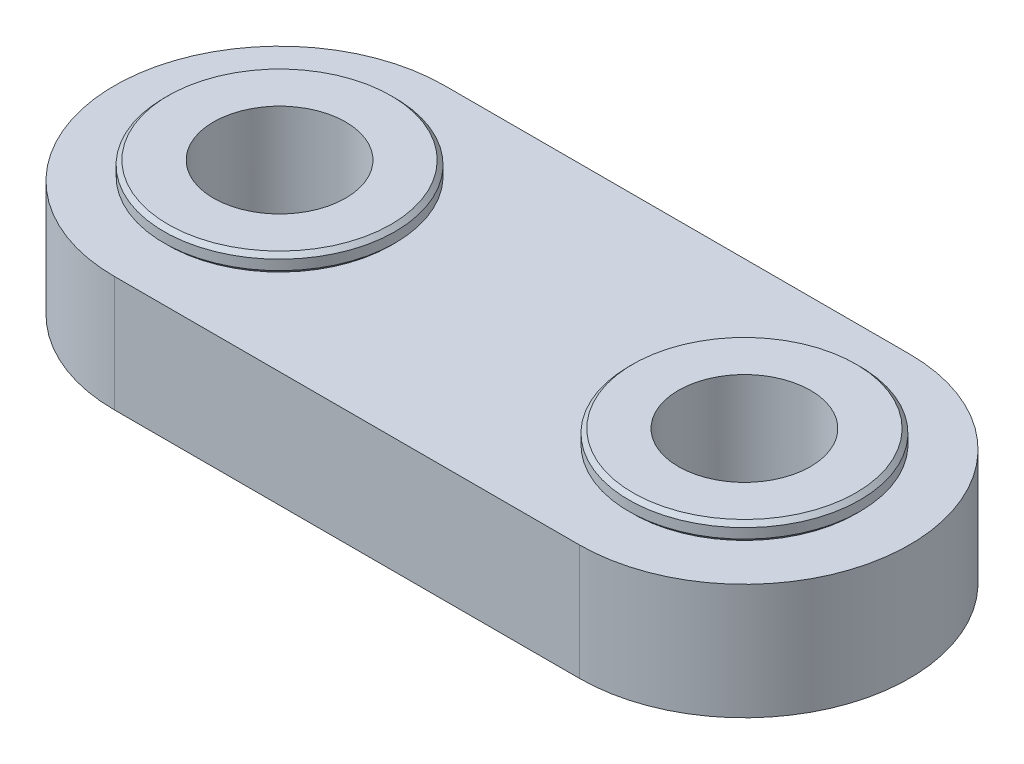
ISO-10303-21;
HEADER;
FILE_DESCRIPTION(('STEP AP214'),'2;1');
FILE_NAME('part.step','',(''),(''),'','','');
FILE_SCHEMA(('AUTOMOTIVE_DESIGN { 1 0 10303 214 1 1 1 1 }'));
ENDSEC;
DATA;
#1=APPLICATION_CONTEXT('core data for automotive mechanical design processes');
#2=APPLICATION_PROTOCOL_DEFINITION('international standard','automotive_design',2000,#1);
#3=PRODUCT_CONTEXT('',#1,'mechanical');
#4=PRODUCT('Part','Part','',(#3));
#5=PRODUCT_RELATED_PRODUCT_CATEGORY('part','',(#4));
#6=PRODUCT_DEFINITION_FORMATION('','',#4);
#7=PRODUCT_DEFINITION_CONTEXT('part definition',#1,'design');
#8=PRODUCT_DEFINITION('design','',#6,#7);
#9=PRODUCT_DEFINITION_SHAPE('','',#8);
#10=(LENGTH_UNIT() NAMED_UNIT(*) SI_UNIT(.MILLI.,.METRE.));
#11=(NAMED_UNIT(*) PLANE_ANGLE_UNIT() SI_UNIT($,.RADIAN.));
#12=(NAMED_UNIT(*) SI_UNIT($,.STERADIAN.) SOLID_ANGLE_UNIT());
#13=UNCERTAINTY_MEASURE_WITH_UNIT(LENGTH_MEASURE(1.E-05),#10,'distance_accuracy_value','');
#14=(GEOMETRIC_REPRESENTATION_CONTEXT(3) GLOBAL_UNCERTAINTY_ASSIGNED_CONTEXT((#13)) GLOBAL_UNIT_ASSIGNED_CONTEXT((#10,
#11,#12)) REPRESENTATION_CONTEXT('',''));
#15=CARTESIAN_POINT('',(0.,0.,0.));
#16=DIRECTION('',(0.,0.,1.));
#17=DIRECTION('',(1.,0.,0.));
#18=AXIS2_PLACEMENT_3D('',#15,#16,#17);
#19=CARTESIAN_POINT('',(28.1439999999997,-4.6,-2.77555756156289E-13));
#20=DIRECTION('',(0.,1.,0.));
#21=DIRECTION('',(-1.,0.,0.));
#22=AXIS2_PLACEMENT_3D('',#19,#20,#21);
#23=CYLINDRICAL_SURFACE('',#22,7.);
#24=CARTESIAN_POINT('',(28.1439999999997,4.35,-2.77555756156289E-13));
#25=DIRECTION('',(0.,1.,0.));
#26=DIRECTION('',(1.,0.,0.));
#27=AXIS2_PLACEMENT_3D('',#24,#25,#26);
#28=CIRCLE('',#27,7.);
#29=CARTESIAN_POINT('',(35.1439999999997,4.35,-2.77555756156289E-13));
#30=VERTEX_POINT('',#29);
#31=EDGE_CURVE('E145',#30,#30,#28,.F.);
#32=ORIENTED_EDGE('',*,*,#31,.T.);
#33=EDGE_LOOP('',(#32));
#34=FACE_BOUND('',#33,.T.);
#35=CARTESIAN_POINT('',(28.1439999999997,3.75,-2.77555756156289E-13));
#36=DIRECTION('',(0.,1.,0.));
#37=DIRECTION('',(-1.,0.,0.));
#38=AXIS2_PLACEMENT_3D('',#35,#36,#37);
#39=CIRCLE('',#38,7.);
#40=CARTESIAN_POINT('',(21.1439999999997,3.75,-2.77555756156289E-13));
#41=VERTEX_POINT('',#40);
#42=EDGE_CURVE('E119',#41,#41,#39,.T.);
#43=ORIENTED_EDGE('',*,*,#42,.T.);
#44=EDGE_LOOP('',(#43));
#45=FACE_BOUND('',#44,.T.);
#46=ADVANCED_FACE('F14',(#34,#45),#23,.T.);
#47=CARTESIAN_POINT('',(28.1439999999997,-4.6,-2.77555756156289E-13));
#48=DIRECTION('',(0.,1.,0.));
#49=DIRECTION('',(-1.,0.,0.));
#50=AXIS2_PLACEMENT_3D('',#47,#48,#49);
#51=CYLINDRICAL_SURFACE('',#50,4.);
#52=CARTESIAN_POINT('',(28.1439999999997,-4.6,-2.77555756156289E-13));
#53=DIRECTION('',(0.,1.,0.));
#54=DIRECTION('',(-1.,0.,0.));
#55=AXIS2_PLACEMENT_3D('',#52,#53,#54);
#56=CIRCLE('',#55,4.);
#57=CARTESIAN_POINT('',(24.1439999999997,-4.6,-2.77555756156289E-13));
#58=VERTEX_POINT('',#57);
#59=EDGE_CURVE('E116',#58,#58,#56,.T.);
#60=ORIENTED_EDGE('',*,*,#59,.F.);
#61=EDGE_LOOP('',(#60));
#62=FACE_BOUND('',#61,.T.);
#63=CARTESIAN_POINT('',(28.1439999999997,4.6,-2.77555756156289E-13));
#64=DIRECTION('',(0.,1.,0.));
#65=DIRECTION('',(1.,0.,0.));
#66=AXIS2_PLACEMENT_3D('',#63,#64,#65);
#67=CIRCLE('',#66,4.);
#68=CARTESIAN_POINT('',(32.1439999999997,4.6,-2.77555756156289E-13));
#69=VERTEX_POINT('',#68);
#70=EDGE_CURVE('E227',#69,#69,#67,.T.);
#71=ORIENTED_EDGE('',*,*,#70,.T.);
#72=EDGE_LOOP('',(#71));
#73=FACE_BOUND('',#72,.T.);
#74=ADVANCED_FACE('F165',(#62,#73),#51,.F.);
#75=CARTESIAN_POINT('',(0.,-4.6,0.));
#76=DIRECTION('',(0.,1.,0.));
#77=DIRECTION('',(-1.,0.,0.));
#78=AXIS2_PLACEMENT_3D('',#75,#76,#77);
#79=CYLINDRICAL_SURFACE('',#78,7.);
#80=CARTESIAN_POINT('',(0.,4.35,0.));
#81=DIRECTION('',(0.,1.,0.));
#82=DIRECTION('',(1.,0.,0.));
#83=AXIS2_PLACEMENT_3D('',#80,#81,#82);
#84=CIRCLE('',#83,7.);
#85=CARTESIAN_POINT('',(7.,4.35,0.));
#86=VERTEX_POINT('',#85);
#87=EDGE_CURVE('E9',#86,#86,#84,.F.);
#88=ORIENTED_EDGE('',*,*,#87,.T.);
#89=EDGE_LOOP('',(#88));
#90=FACE_BOUND('',#89,.T.);
#91=CARTESIAN_POINT('',(0.,3.75,0.));
#92=DIRECTION('',(0.,1.,0.));
#93=DIRECTION('',(-1.,0.,0.));
#94=AXIS2_PLACEMENT_3D('',#91,#92,#93);
#95=CIRCLE('',#94,7.);
#96=CARTESIAN_POINT('',(-7.,3.75,0.));
#97=VERTEX_POINT('',#96);
#98=EDGE_CURVE('E113',#97,#97,#95,.T.);
#99=ORIENTED_EDGE('',*,*,#98,.T.);
#100=EDGE_LOOP('',(#99));
#101=FACE_BOUND('',#100,.T.);
#102=ADVANCED_FACE('F172',(#90,#101),#79,.T.);
#103=CARTESIAN_POINT('',(0.,-4.6,0.));
#104=DIRECTION('',(0.,1.,0.));
#105=DIRECTION('',(-1.,0.,0.));
#106=AXIS2_PLACEMENT_3D('',#103,#104,#105);
#107=CYLINDRICAL_SURFACE('',#106,4.);
#108=CARTESIAN_POINT('',(0.,-4.6,0.));
#109=DIRECTION('',(0.,1.,0.));
#110=DIRECTION('',(-1.,0.,0.));
#111=AXIS2_PLACEMENT_3D('',#108,#109,#110);
#112=CIRCLE('',#111,4.);
#113=CARTESIAN_POINT('',(-4.,-4.6,0.));
#114=VERTEX_POINT('',#113);
#115=EDGE_CURVE('E108',#114,#114,#112,.T.);
#116=ORIENTED_EDGE('',*,*,#115,.F.);
#117=EDGE_LOOP('',(#116));
#118=FACE_BOUND('',#117,.T.);
#119=CARTESIAN_POINT('',(0.,4.6,0.));
#120=DIRECTION('',(0.,1.,0.));
#121=DIRECTION('',(1.,0.,0.));
#122=AXIS2_PLACEMENT_3D('',#119,#120,#121);
#123=CIRCLE('',#122,4.);
#124=CARTESIAN_POINT('',(4.,4.6,0.));
#125=VERTEX_POINT('',#124);
#126=EDGE_CURVE('E130',#125,#125,#123,.T.);
#127=ORIENTED_EDGE('',*,*,#126,.T.);
#128=EDGE_LOOP('',(#127));
#129=FACE_BOUND('',#128,.T.);
#130=ADVANCED_FACE('F178',(#118,#129),#107,.F.);
#131=CARTESIAN_POINT('',(0.,0.,0.));
#132=DIRECTION('',(0.,-1.,0.));
#133=DIRECTION('',(-1.,0.,0.));
#134=AXIS2_PLACEMENT_3D('',#131,#132,#133);
#135=CYLINDRICAL_SURFACE('',#134,10.);
#136=CARTESIAN_POINT('',(0.,-3.5,0.));
#137=DIRECTION('',(0.,1.,0.));
#138=DIRECTION('',(1.,0.,0.));
#139=AXIS2_PLACEMENT_3D('',#136,#137,#138);
#140=CIRCLE('',#139,10.);
#141=CARTESIAN_POINT('',(0.,-3.5,-10.));
#142=VERTEX_POINT('',#141);
#143=CARTESIAN_POINT('',(0.,-3.5,10.));
#144=VERTEX_POINT('',#143);
#145=EDGE_CURVE('E59',#142,#144,#140,.T.);
#146=ORIENTED_EDGE('',*,*,#145,.T.);
#147=DIRECTION('',(0.,-1.,0.));
#148=VECTOR('',#147,1.);
#149=CARTESIAN_POINT('',(0.,0.,10.));
#150=LINE('',#149,#148);
#151=CARTESIAN_POINT('',(0.,3.5,10.));
#152=VERTEX_POINT('',#151);
#153=EDGE_CURVE('E65',#152,#144,#150,.T.);
#154=ORIENTED_EDGE('',*,*,#153,.F.);
#155=CARTESIAN_POINT('',(0.,3.5,0.));
#156=DIRECTION('',(0.,1.,0.));
#157=DIRECTION('',(1.,0.,0.));
#158=AXIS2_PLACEMENT_3D('',#155,#156,#157);
#159=CIRCLE('',#158,10.);
#160=CARTESIAN_POINT('',(0.,3.5,-10.));
#161=VERTEX_POINT('',#160);
#162=EDGE_CURVE('E99',#161,#152,#159,.T.);
#163=ORIENTED_EDGE('',*,*,#162,.F.);
#164=DIRECTION('',(0.,-1.,0.));
#165=VECTOR('',#164,1.);
#166=CARTESIAN_POINT('',(0.,0.,-10.));
#167=LINE('',#166,#165);
#168=EDGE_CURVE('E67',#161,#142,#167,.T.);
#169=ORIENTED_EDGE('',*,*,#168,.T.);
#170=EDGE_LOOP('',(#146,#154,#163,#169));
#171=FACE_BOUND('',#170,.T.);
#172=ADVANCED_FACE('F63',(#171),#135,.T.);
#173=CARTESIAN_POINT('',(0.,0.,10.));
#174=DIRECTION('',(0.,0.,-1.));
#175=DIRECTION('',(0.,1.,0.));
#176=AXIS2_PLACEMENT_3D('',#173,#174,#175);
#177=PLANE('',#176);
#178=DIRECTION('',(1.,0.,0.));
#179=VECTOR('',#178,1.);
#180=CARTESIAN_POINT('',(0.,-3.5,10.));
#181=LINE('',#180,#179);
#182=CARTESIAN_POINT('',(28.144,-3.5,10.));
#183=VERTEX_POINT('',#182);
#184=EDGE_CURVE('E70',#144,#183,#181,.T.);
#185=ORIENTED_EDGE('',*,*,#184,.T.);
#186=DIRECTION('',(0.,-1.,0.));
#187=VECTOR('',#186,1.);
#188=CARTESIAN_POINT('',(28.144,0.,10.));
#189=LINE('',#188,#187);
#190=CARTESIAN_POINT('',(28.144,3.5,10.));
#191=VERTEX_POINT('',#190);
#192=EDGE_CURVE('E47',#191,#183,#189,.T.);
#193=ORIENTED_EDGE('',*,*,#192,.F.);
#194=DIRECTION('',(1.,0.,0.));
#195=VECTOR('',#194,1.);
#196=CARTESIAN_POINT('',(0.,3.5,10.));
#197=LINE('',#196,#195);
#198=EDGE_CURVE('E74',#152,#191,#197,.T.);
#199=ORIENTED_EDGE('',*,*,#198,.F.);
#200=ORIENTED_EDGE('',*,*,#153,.T.);
#201=EDGE_LOOP('',(#185,#193,#199,#200));
#202=FACE_BOUND('',#201,.T.);
#203=ADVANCED_FACE('F73',(#202),#177,.F.);
#204=CARTESIAN_POINT('',(28.144,0.,0.));
#205=DIRECTION('',(0.,-1.,0.));
#206=DIRECTION('',(-1.,0.,0.));
#207=AXIS2_PLACEMENT_3D('',#204,#205,#206);
#208=CYLINDRICAL_SURFACE('',#207,10.);
#209=CARTESIAN_POINT('',(28.144,-3.5,0.));
#210=DIRECTION('',(0.,1.,0.));
#211=DIRECTION('',(-1.,0.,0.));
#212=AXIS2_PLACEMENT_3D('',#209,#210,#211);
#213=CIRCLE('',#212,10.);
#214=CARTESIAN_POINT('',(28.144,-3.5,-10.));
#215=VERTEX_POINT('',#214);
#216=EDGE_CURVE('E31',#183,#215,#213,.T.);
#217=ORIENTED_EDGE('',*,*,#216,.T.);
#218=DIRECTION('',(0.,-1.,0.));
#219=VECTOR('',#218,1.);
#220=CARTESIAN_POINT('',(28.144,0.,-10.));
#221=LINE('',#220,#219);
#222=CARTESIAN_POINT('',(28.144,3.5,-10.));
#223=VERTEX_POINT('',#222);
#224=EDGE_CURVE('E51',#223,#215,#221,.T.);
#225=ORIENTED_EDGE('',*,*,#224,.F.);
#226=CARTESIAN_POINT('',(28.144,3.5,0.));
#227=DIRECTION('',(0.,1.,0.));
#228=DIRECTION('',(-1.,0.,0.));
#229=AXIS2_PLACEMENT_3D('',#226,#227,#228);
#230=CIRCLE('',#229,10.);
#231=EDGE_CURVE('E103',#191,#223,#230,.T.);
#232=ORIENTED_EDGE('',*,*,#231,.F.);
#233=ORIENTED_EDGE('',*,*,#192,.T.);
#234=EDGE_LOOP('',(#217,#225,#232,#233));
#235=FACE_BOUND('',#234,.T.);
#236=ADVANCED_FACE('F264',(#235),#208,.T.);
#237=CARTESIAN_POINT('',(28.144,0.,-10.));
#238=DIRECTION('',(0.,0.,1.));
#239=DIRECTION('',(0.,-1.,0.));
#240=AXIS2_PLACEMENT_3D('',#237,#238,#239);
#241=PLANE('',#240);
#242=DIRECTION('',(-1.,0.,0.));
#243=VECTOR('',#242,1.);
#244=CARTESIAN_POINT('',(28.144,-3.5,-10.));
#245=LINE('',#244,#243);
#246=EDGE_CURVE('E71',#215,#142,#245,.T.);
#247=ORIENTED_EDGE('',*,*,#246,.T.);
#248=ORIENTED_EDGE('',*,*,#168,.F.);
#249=DIRECTION('',(-1.,0.,0.));
#250=VECTOR('',#249,1.);
#251=CARTESIAN_POINT('',(28.144,3.5,-10.));
#252=LINE('',#251,#250);
#253=EDGE_CURVE('E101',#223,#161,#252,.T.);
#254=ORIENTED_EDGE('',*,*,#253,.F.);
#255=ORIENTED_EDGE('',*,*,#224,.T.);
#256=EDGE_LOOP('',(#247,#248,#254,#255));
#257=FACE_BOUND('',#256,.T.);
#258=ADVANCED_FACE('F262',(#257),#241,.F.);
#259=CARTESIAN_POINT('',(0.,-3.5,0.));
#260=DIRECTION('',(0.,1.,0.));
#261=DIRECTION('',(1.,0.,0.));
#262=AXIS2_PLACEMENT_3D('',#259,#260,#261);
#263=PLANE('',#262);
#264=CARTESIAN_POINT('',(28.1439999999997,-3.5,-2.77555756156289E-13));
#265=DIRECTION('',(0.,1.,0.));
#266=DIRECTION('',(1.,0.,0.));
#267=AXIS2_PLACEMENT_3D('',#264,#265,#266);
#268=CIRCLE('',#267,7.3);
#269=CARTESIAN_POINT('',(35.4439999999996,-3.5,-2.77555756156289E-13));
#270=VERTEX_POINT('',#269);
#271=EDGE_CURVE('E92',#270,#270,#268,.F.);
#272=ORIENTED_EDGE('',*,*,#271,.F.);
#273=EDGE_LOOP('',(#272));
#274=FACE_BOUND('',#273,.T.);
#275=ORIENTED_EDGE('',*,*,#246,.F.);
#276=ORIENTED_EDGE('',*,*,#216,.F.);
#277=ORIENTED_EDGE('',*,*,#184,.F.);
#278=ORIENTED_EDGE('',*,*,#145,.F.);
#279=EDGE_LOOP('',(#275,#276,#277,#278));
#280=FACE_BOUND('',#279,.T.);
#281=CARTESIAN_POINT('',(0.,-3.5,0.));
#282=DIRECTION('',(0.,1.,0.));
#283=DIRECTION('',(1.,0.,0.));
#284=AXIS2_PLACEMENT_3D('',#281,#282,#283);
#285=CIRCLE('',#284,7.3);
#286=CARTESIAN_POINT('',(7.3,-3.5,0.));
#287=VERTEX_POINT('',#286);
#288=EDGE_CURVE('E95',#287,#287,#285,.F.);
#289=ORIENTED_EDGE('',*,*,#288,.F.);
#290=EDGE_LOOP('',(#289));
#291=FACE_BOUND('',#290,.T.);
#292=ADVANCED_FACE('F76',(#274,#280,#291),#263,.F.);
#293=CARTESIAN_POINT('',(28.1439999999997,-3.5,-2.77555756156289E-13));
#294=DIRECTION('',(0.,-1.,0.));
#295=DIRECTION('',(1.,0.,0.));
#296=AXIS2_PLACEMENT_3D('',#293,#294,#295);
#297=CYLINDRICAL_SURFACE('',#296,7.5);
#298=CARTESIAN_POINT('',(28.1439999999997,-4.35,-2.77555756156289E-13));
#299=DIRECTION('',(0.,1.,0.));
#300=DIRECTION('',(1.,0.,0.));
#301=AXIS2_PLACEMENT_3D('',#298,#299,#300);
#302=CIRCLE('',#301,7.5);
#303=CARTESIAN_POINT('',(35.6439999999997,-4.35,-2.77555756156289E-13));
#304=VERTEX_POINT('',#303);
#305=EDGE_CURVE('E139',#304,#304,#302,.T.);
#306=ORIENTED_EDGE('',*,*,#305,.T.);
#307=EDGE_LOOP('',(#306));
#308=FACE_BOUND('',#307,.T.);
#309=CARTESIAN_POINT('',(28.1439999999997,-3.7,-2.77555756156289E-13));
#310=DIRECTION('',(0.,-1.,0.));
#311=DIRECTION('',(1.,0.,0.));
#312=AXIS2_PLACEMENT_3D('',#309,#310,#311);
#313=CIRCLE('',#312,7.5);
#314=CARTESIAN_POINT('',(35.6439999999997,-3.7,-2.77555756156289E-13));
#315=VERTEX_POINT('',#314);
#316=EDGE_CURVE('E127',#315,#315,#313,.T.);
#317=ORIENTED_EDGE('',*,*,#316,.T.);
#318=EDGE_LOOP('',(#317));
#319=FACE_BOUND('',#318,.T.);
#320=ADVANCED_FACE('F201',(#308,#319),#297,.T.);
#321=CARTESIAN_POINT('',(28.1439999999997,-3.5,-2.77555756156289E-13));
#322=DIRECTION('',(0.,-1.,0.));
#323=DIRECTION('',(1.,0.,0.));
#324=AXIS2_PLACEMENT_3D('',#321,#322,#323);
#325=CONICAL_SURFACE('',#324,7.3,0.785398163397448);
#326=ORIENTED_EDGE('',*,*,#316,.F.);
#327=EDGE_LOOP('',(#326));
#328=FACE_BOUND('',#327,.T.);
#329=ORIENTED_EDGE('',*,*,#271,.T.);
#330=EDGE_LOOP('',(#329));
#331=FACE_BOUND('',#330,.T.);
#332=ADVANCED_FACE('F196',(#328,#331),#325,.T.);
#333=CARTESIAN_POINT('',(0.,-3.5,0.));
#334=DIRECTION('',(0.,-1.,0.));
#335=DIRECTION('',(1.,0.,0.));
#336=AXIS2_PLACEMENT_3D('',#333,#334,#335);
#337=CYLINDRICAL_SURFACE('',#336,7.5);
#338=CARTESIAN_POINT('',(0.,-4.35,0.));
#339=DIRECTION('',(0.,1.,0.));
#340=DIRECTION('',(1.,0.,0.));
#341=AXIS2_PLACEMENT_3D('',#338,#339,#340);
#342=CIRCLE('',#341,7.5);
#343=CARTESIAN_POINT('',(7.5,-4.35,0.));
#344=VERTEX_POINT('',#343);
#345=EDGE_CURVE('E133',#344,#344,#342,.T.);
#346=ORIENTED_EDGE('',*,*,#345,.T.);
#347=EDGE_LOOP('',(#346));
#348=FACE_BOUND('',#347,.T.);
#349=CARTESIAN_POINT('',(0.,-3.7,0.));
#350=DIRECTION('',(0.,-1.,0.));
#351=DIRECTION('',(1.,0.,0.));
#352=AXIS2_PLACEMENT_3D('',#349,#350,#351);
#353=CIRCLE('',#352,7.5);
#354=CARTESIAN_POINT('',(7.5,-3.7,0.));
#355=VERTEX_POINT('',#354);
#356=EDGE_CURVE('E122',#355,#355,#353,.T.);
#357=ORIENTED_EDGE('',*,*,#356,.T.);
#358=EDGE_LOOP('',(#357));
#359=FACE_BOUND('',#358,.T.);
#360=ADVANCED_FACE('F192',(#348,#359),#337,.T.);
#361=CARTESIAN_POINT('',(0.,-3.5,0.));
#362=DIRECTION('',(0.,-1.,0.));
#363=DIRECTION('',(1.,0.,0.));
#364=AXIS2_PLACEMENT_3D('',#361,#362,#363);
#365=CONICAL_SURFACE('',#364,7.3,0.785398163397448);
#366=ORIENTED_EDGE('',*,*,#356,.F.);
#367=EDGE_LOOP('',(#366));
#368=FACE_BOUND('',#367,.T.);
#369=ORIENTED_EDGE('',*,*,#288,.T.);
#370=EDGE_LOOP('',(#369));
#371=FACE_BOUND('',#370,.T.);
#372=ADVANCED_FACE('F195',(#368,#371),#365,.T.);
#373=CARTESIAN_POINT('',(0.,3.5,0.));
#374=DIRECTION('',(0.,1.,0.));
#375=DIRECTION('',(-1.,0.,0.));
#376=AXIS2_PLACEMENT_3D('',#373,#374,#375);
#377=CONICAL_SURFACE('',#376,6.75,0.785398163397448);
#378=ORIENTED_EDGE('',*,*,#98,.F.);
#379=EDGE_LOOP('',(#378));
#380=FACE_BOUND('',#379,.T.);
#381=CARTESIAN_POINT('',(0.,3.5,0.));
#382=DIRECTION('',(0.,1.,0.));
#383=DIRECTION('',(1.,0.,0.));
#384=AXIS2_PLACEMENT_3D('',#381,#382,#383);
#385=CIRCLE('',#384,6.75);
#386=CARTESIAN_POINT('',(6.75,3.5,0.));
#387=VERTEX_POINT('',#386);
#388=EDGE_CURVE('E88',#387,#387,#385,.F.);
#389=ORIENTED_EDGE('',*,*,#388,.F.);
#390=EDGE_LOOP('',(#389));
#391=FACE_BOUND('',#390,.T.);
#392=ADVANCED_FACE('F184',(#380,#391),#377,.T.);
#393=CARTESIAN_POINT('',(28.1439999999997,3.5,-2.77555756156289E-13));
#394=DIRECTION('',(0.,1.,0.));
#395=DIRECTION('',(-1.,0.,0.));
#396=AXIS2_PLACEMENT_3D('',#393,#394,#395);
#397=CONICAL_SURFACE('',#396,6.75,0.785398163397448);
#398=ORIENTED_EDGE('',*,*,#42,.F.);
#399=EDGE_LOOP('',(#398));
#400=FACE_BOUND('',#399,.T.);
#401=CARTESIAN_POINT('',(28.1439999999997,3.5,-2.77555756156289E-13));
#402=DIRECTION('',(0.,1.,0.));
#403=DIRECTION('',(1.,0.,0.));
#404=AXIS2_PLACEMENT_3D('',#401,#402,#403);
#405=CIRCLE('',#404,6.75);
#406=CARTESIAN_POINT('',(34.8939999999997,3.5,-2.77555756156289E-13));
#407=VERTEX_POINT('',#406);
#408=EDGE_CURVE('E105',#407,#407,#405,.F.);
#409=ORIENTED_EDGE('',*,*,#408,.F.);
#410=EDGE_LOOP('',(#409));
#411=FACE_BOUND('',#410,.T.);
#412=ADVANCED_FACE('F180',(#400,#411),#397,.T.);
#413=CARTESIAN_POINT('',(0.,3.5,0.));
#414=DIRECTION('',(0.,1.,0.));
#415=DIRECTION('',(1.,0.,0.));
#416=AXIS2_PLACEMENT_3D('',#413,#414,#415);
#417=PLANE('',#416);
#418=ORIENTED_EDGE('',*,*,#408,.T.);
#419=EDGE_LOOP('',(#418));
#420=FACE_BOUND('',#419,.T.);
#421=ORIENTED_EDGE('',*,*,#253,.T.);
#422=ORIENTED_EDGE('',*,*,#162,.T.);
#423=ORIENTED_EDGE('',*,*,#198,.T.);
#424=ORIENTED_EDGE('',*,*,#231,.T.);
#425=EDGE_LOOP('',(#421,#422,#423,#424));
#426=FACE_BOUND('',#425,.T.);
#427=ORIENTED_EDGE('',*,*,#388,.T.);
#428=EDGE_LOOP('',(#427));
#429=FACE_BOUND('',#428,.T.);
#430=ADVANCED_FACE('F183',(#420,#426,#429),#417,.T.);
#431=CARTESIAN_POINT('',(0.,-4.6,4.));
#432=DIRECTION('',(0.,1.,0.));
#433=DIRECTION('',(-1.,0.,0.));
#434=AXIS2_PLACEMENT_3D('',#431,#432,#433);
#435=PLANE('',#434);
#436=CARTESIAN_POINT('',(0.,-4.6,0.));
#437=DIRECTION('',(0.,1.,0.));
#438=DIRECTION('',(1.,0.,0.));
#439=AXIS2_PLACEMENT_3D('',#436,#437,#438);
#440=CIRCLE('',#439,7.25);
#441=CARTESIAN_POINT('',(7.25,-4.6,0.));
#442=VERTEX_POINT('',#441);
#443=EDGE_CURVE('E98',#442,#442,#440,.F.);
#444=ORIENTED_EDGE('',*,*,#443,.T.);
#445=EDGE_LOOP('',(#444));
#446=FACE_BOUND('',#445,.T.);
#447=ORIENTED_EDGE('',*,*,#115,.T.);
#448=EDGE_LOOP('',(#447));
#449=FACE_BOUND('',#448,.T.);
#450=ADVANCED_FACE('F189',(#446,#449),#435,.F.);
#451=CARTESIAN_POINT('',(28.1439999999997,-4.6,3.99999999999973));
#452=DIRECTION('',(0.,1.,0.));
#453=DIRECTION('',(-1.,0.,0.));
#454=AXIS2_PLACEMENT_3D('',#451,#452,#453);
#455=PLANE('',#454);
#456=CARTESIAN_POINT('',(28.1439999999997,-4.6,-2.77555756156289E-13));
#457=DIRECTION('',(0.,1.,0.));
#458=DIRECTION('',(1.,0.,0.));
#459=AXIS2_PLACEMENT_3D('',#456,#457,#458);
#460=CIRCLE('',#459,7.25);
#461=CARTESIAN_POINT('',(35.3939999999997,-4.6,-2.77555756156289E-13));
#462=VERTEX_POINT('',#461);
#463=EDGE_CURVE('E136',#462,#462,#460,.F.);
#464=ORIENTED_EDGE('',*,*,#463,.T.);
#465=EDGE_LOOP('',(#464));
#466=FACE_BOUND('',#465,.T.);
#467=ORIENTED_EDGE('',*,*,#59,.T.);
#468=EDGE_LOOP('',(#467));
#469=FACE_BOUND('',#468,.T.);
#470=ADVANCED_FACE('F186',(#466,#469),#455,.F.);
#471=CARTESIAN_POINT('',(0.,-4.6,0.));
#472=DIRECTION('',(0.,1.,0.));
#473=DIRECTION('',(1.,0.,0.));
#474=AXIS2_PLACEMENT_3D('',#471,#472,#473);
#475=CONICAL_SURFACE('',#474,7.25,0.785398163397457);
#476=ORIENTED_EDGE('',*,*,#345,.F.);
#477=EDGE_LOOP('',(#476));
#478=FACE_BOUND('',#477,.T.);
#479=ORIENTED_EDGE('',*,*,#443,.F.);
#480=EDGE_LOOP('',(#479));
#481=FACE_BOUND('',#480,.T.);
#482=ADVANCED_FACE('F188',(#478,#481),#475,.T.);
#483=CARTESIAN_POINT('',(28.1439999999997,-4.6,-2.77555756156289E-13));
#484=DIRECTION('',(0.,1.,0.));
#485=DIRECTION('',(1.,0.,0.));
#486=AXIS2_PLACEMENT_3D('',#483,#484,#485);
#487=CONICAL_SURFACE('',#486,7.25,0.785398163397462);
#488=ORIENTED_EDGE('',*,*,#305,.F.);
#489=EDGE_LOOP('',(#488));
#490=FACE_BOUND('',#489,.T.);
#491=ORIENTED_EDGE('',*,*,#463,.F.);
#492=EDGE_LOOP('',(#491));
#493=FACE_BOUND('',#492,.T.);
#494=ADVANCED_FACE('F210',(#490,#493),#487,.T.);
#495=CARTESIAN_POINT('',(0.,4.6,0.));
#496=DIRECTION('',(0.,1.,0.));
#497=DIRECTION('',(1.,0.,0.));
#498=AXIS2_PLACEMENT_3D('',#495,#496,#497);
#499=PLANE('',#498);
#500=CARTESIAN_POINT('',(0.,4.6,0.));
#501=DIRECTION('',(0.,1.,0.));
#502=DIRECTION('',(1.,0.,0.));
#503=AXIS2_PLACEMENT_3D('',#500,#501,#502);
#504=CIRCLE('',#503,6.75);
#505=CARTESIAN_POINT('',(6.75,4.6,0.));
#506=VERTEX_POINT('',#505);
#507=EDGE_CURVE('E23',#506,#506,#504,.T.);
#508=ORIENTED_EDGE('',*,*,#507,.T.);
#509=EDGE_LOOP('',(#508));
#510=FACE_BOUND('',#509,.T.);
#511=ORIENTED_EDGE('',*,*,#126,.F.);
#512=EDGE_LOOP('',(#511));
#513=FACE_BOUND('',#512,.T.);
#514=ADVANCED_FACE('F150',(#510,#513),#499,.T.);
#515=CARTESIAN_POINT('',(28.1439999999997,4.6,-2.77555756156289E-13));
#516=DIRECTION('',(0.,1.,0.));
#517=DIRECTION('',(1.,0.,0.));
#518=AXIS2_PLACEMENT_3D('',#515,#516,#517);
#519=PLANE('',#518);
#520=CARTESIAN_POINT('',(28.1439999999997,4.6,-2.77555756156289E-13));
#521=DIRECTION('',(0.,1.,0.));
#522=DIRECTION('',(1.,0.,0.));
#523=AXIS2_PLACEMENT_3D('',#520,#521,#522);
#524=CIRCLE('',#523,6.75);
#525=CARTESIAN_POINT('',(34.8939999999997,4.6,-2.77555756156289E-13));
#526=VERTEX_POINT('',#525);
#527=EDGE_CURVE('E142',#526,#526,#524,.T.);
#528=ORIENTED_EDGE('',*,*,#527,.T.);
#529=EDGE_LOOP('',(#528));
#530=FACE_BOUND('',#529,.T.);
#531=ORIENTED_EDGE('',*,*,#70,.F.);
#532=EDGE_LOOP('',(#531));
#533=FACE_BOUND('',#532,.T.);
#534=ADVANCED_FACE('F161',(#530,#533),#519,.T.);
#535=CARTESIAN_POINT('',(28.1439999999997,4.6,-2.77555756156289E-13));
#536=DIRECTION('',(0.,-1.,0.));
#537=DIRECTION('',(-1.,0.,0.));
#538=AXIS2_PLACEMENT_3D('',#535,#536,#537);
#539=CONICAL_SURFACE('',#538,6.75,0.785398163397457);
#540=ORIENTED_EDGE('',*,*,#31,.F.);
#541=EDGE_LOOP('',(#540));
#542=FACE_BOUND('',#541,.T.);
#543=ORIENTED_EDGE('',*,*,#527,.F.);
#544=EDGE_LOOP('',(#543));
#545=FACE_BOUND('',#544,.T.);
#546=ADVANCED_FACE('F154',(#542,#545),#539,.T.);
#547=CARTESIAN_POINT('',(0.,4.6,0.));
#548=DIRECTION('',(0.,-1.,0.));
#549=DIRECTION('',(-1.,0.,0.));
#550=AXIS2_PLACEMENT_3D('',#547,#548,#549);
#551=CONICAL_SURFACE('',#550,6.75,0.785398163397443);
#552=ORIENTED_EDGE('',*,*,#87,.F.);
#553=EDGE_LOOP('',(#552));
#554=FACE_BOUND('',#553,.T.);
#555=ORIENTED_EDGE('',*,*,#507,.F.);
#556=EDGE_LOOP('',(#555));
#557=FACE_BOUND('',#556,.T.);
#558=ADVANCED_FACE('F16',(#554,#557),#551,.T.);
#559=CLOSED_SHELL('',(#46,#74,#102,#130,#172,#203,#236,#258,#292,#320,#332,#360,#372,#392,#412,
#430,#450,#470,#482,#494,#514,#534,#546,#558));
#560=MANIFOLD_SOLID_BREP('B1',#559);
#561=ADVANCED_BREP_SHAPE_REPRESENTATION('',(#18,#560),#14);
#562=SHAPE_DEFINITION_REPRESENTATION(#9,#561);
ENDSEC;
END-ISO-10303-21;
